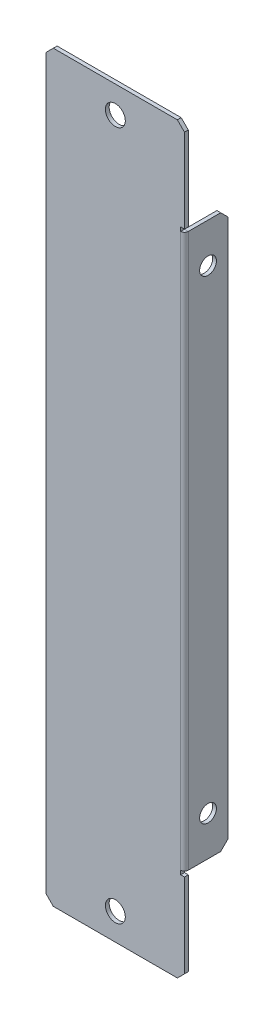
ISO-10303-21;
HEADER;
FILE_DESCRIPTION(('STEP AP214'),'2;1');
FILE_NAME('part.step','',(''),(''),'','','');
FILE_SCHEMA(('AUTOMOTIVE_DESIGN { 1 0 10303 214 1 1 1 1 }'));
ENDSEC;
DATA;
#1=APPLICATION_CONTEXT('core data for automotive mechanical design processes');
#2=APPLICATION_PROTOCOL_DEFINITION('international standard','automotive_design',2000,#1);
#3=PRODUCT_CONTEXT('',#1,'mechanical');
#4=PRODUCT('Part','Part','',(#3));
#5=PRODUCT_RELATED_PRODUCT_CATEGORY('part','',(#4));
#6=PRODUCT_DEFINITION_FORMATION('','',#4);
#7=PRODUCT_DEFINITION_CONTEXT('part definition',#1,'design');
#8=PRODUCT_DEFINITION('design','',#6,#7);
#9=PRODUCT_DEFINITION_SHAPE('','',#8);
#10=(LENGTH_UNIT() NAMED_UNIT(*) SI_UNIT(.MILLI.,.METRE.));
#11=(NAMED_UNIT(*) PLANE_ANGLE_UNIT() SI_UNIT($,.RADIAN.));
#12=(NAMED_UNIT(*) SI_UNIT($,.STERADIAN.) SOLID_ANGLE_UNIT());
#13=UNCERTAINTY_MEASURE_WITH_UNIT(LENGTH_MEASURE(1.E-05),#10,'distance_accuracy_value','');
#14=(GEOMETRIC_REPRESENTATION_CONTEXT(3) GLOBAL_UNCERTAINTY_ASSIGNED_CONTEXT((#13)) GLOBAL_UNIT_ASSIGNED_CONTEXT((#10,
#11,#12)) REPRESENTATION_CONTEXT('',''));
#15=CARTESIAN_POINT('',(0.,0.,0.));
#16=DIRECTION('',(0.,0.,1.));
#17=DIRECTION('',(1.,0.,0.));
#18=AXIS2_PLACEMENT_3D('',#15,#16,#17);
#19=CARTESIAN_POINT('',(22.225,119.4308,-1.2192));
#20=DIRECTION('',(1.,0.,0.));
#21=DIRECTION('',(0.,1.,0.));
#22=AXIS2_PLACEMENT_3D('',#19,#20,#21);
#23=PLANE('',#22);
#24=DIRECTION('',(0.,1.,0.));
#25=VECTOR('',#24,1.);
#26=CARTESIAN_POINT('',(22.225,119.4308,0.));
#27=LINE('',#26,#25);
#28=CARTESIAN_POINT('',(22.225,-117.1448,0.));
#29=VERTEX_POINT('',#28);
#30=CARTESIAN_POINT('',(22.225,-90.17,0.));
#31=VERTEX_POINT('',#30);
#32=EDGE_CURVE('E323',#29,#31,#27,.T.);
#33=ORIENTED_EDGE('',*,*,#32,.F.);
#34=DIRECTION('',(0.,0.,-1.));
#35=VECTOR('',#34,1.);
#36=CARTESIAN_POINT('',(22.225,-117.1448,-1.2192));
#37=LINE('',#36,#35);
#38=CARTESIAN_POINT('',(22.225,-117.1448,-1.2192));
#39=VERTEX_POINT('',#38);
#40=EDGE_CURVE('E386',#29,#39,#37,.T.);
#41=ORIENTED_EDGE('',*,*,#40,.T.);
#42=DIRECTION('',(0.,1.,0.));
#43=VECTOR('',#42,1.);
#44=CARTESIAN_POINT('',(22.225,119.4308,-1.2192));
#45=LINE('',#44,#43);
#46=CARTESIAN_POINT('',(22.225,-90.17,-1.21919999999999));
#47=VERTEX_POINT('',#46);
#48=EDGE_CURVE('E311',#39,#47,#45,.T.);
#49=ORIENTED_EDGE('',*,*,#48,.T.);
#50=DIRECTION('',(0.,0.,1.));
#51=VECTOR('',#50,1.);
#52=CARTESIAN_POINT('',(22.225,-90.17,-1.21919999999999));
#53=LINE('',#52,#51);
#54=EDGE_CURVE('E270',#47,#31,#53,.T.);
#55=ORIENTED_EDGE('',*,*,#54,.T.);
#56=EDGE_LOOP('',(#33,#41,#49,#55));
#57=FACE_BOUND('',#56,.T.);
#58=ADVANCED_FACE('F57',(#57),#23,.T.);
#59=CARTESIAN_POINT('',(22.225,90.17,-1.21919999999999));
#60=VERTEX_POINT('',#59);
#61=CARTESIAN_POINT('',(22.225,117.1448,-1.2192));
#62=VERTEX_POINT('',#61);
#63=EDGE_CURVE('E310',#60,#62,#45,.T.);
#64=ORIENTED_EDGE('',*,*,#63,.T.);
#65=DIRECTION('',(0.,0.,1.));
#66=VECTOR('',#65,1.);
#67=CARTESIAN_POINT('',(22.225,117.1448,-1.2192));
#68=LINE('',#67,#66);
#69=CARTESIAN_POINT('',(22.225,117.1448,0.));
#70=VERTEX_POINT('',#69);
#71=EDGE_CURVE('E343',#62,#70,#68,.T.);
#72=ORIENTED_EDGE('',*,*,#71,.T.);
#73=CARTESIAN_POINT('',(22.225,90.17,0.));
#74=VERTEX_POINT('',#73);
#75=EDGE_CURVE('E322',#74,#70,#27,.T.);
#76=ORIENTED_EDGE('',*,*,#75,.F.);
#77=DIRECTION('',(0.,0.,1.));
#78=VECTOR('',#77,1.);
#79=CARTESIAN_POINT('',(22.225,90.17,-1.21919999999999));
#80=LINE('',#79,#78);
#81=EDGE_CURVE('E280',#60,#74,#80,.T.);
#82=ORIENTED_EDGE('',*,*,#81,.F.);
#83=EDGE_LOOP('',(#64,#72,#76,#82));
#84=FACE_BOUND('',#83,.T.);
#85=ADVANCED_FACE('F425',(#84),#23,.T.);
#86=CARTESIAN_POINT('',(-22.225,-119.4308,-1.2192));
#87=DIRECTION('',(0.,0.,1.));
#88=DIRECTION('',(1.,0.,0.));
#89=AXIS2_PLACEMENT_3D('',#86,#87,#88);
#90=PLANE('',#89);
#91=CARTESIAN_POINT('',(0.,110.7948,-1.2192));
#92=DIRECTION('',(0.,0.,1.));
#93=DIRECTION('',(1.,0.,0.));
#94=AXIS2_PLACEMENT_3D('',#91,#92,#93);
#95=CIRCLE('',#94,3.2004);
#96=CARTESIAN_POINT('',(3.2004,110.7948,-1.2192));
#97=VERTEX_POINT('',#96);
#98=EDGE_CURVE('E297',#97,#97,#95,.T.);
#99=ORIENTED_EDGE('',*,*,#98,.T.);
#100=EDGE_LOOP('',(#99));
#101=FACE_BOUND('',#100,.T.);
#102=CARTESIAN_POINT('',(0.,-110.7948,-1.2192));
#103=DIRECTION('',(0.,0.,1.));
#104=DIRECTION('',(-1.,0.,0.));
#105=AXIS2_PLACEMENT_3D('',#102,#103,#104);
#106=CIRCLE('',#105,3.2004);
#107=CARTESIAN_POINT('',(-3.2004,-110.7948,-1.2192));
#108=VERTEX_POINT('',#107);
#109=EDGE_CURVE('E291',#108,#108,#106,.T.);
#110=ORIENTED_EDGE('',*,*,#109,.T.);
#111=EDGE_LOOP('',(#110));
#112=FACE_BOUND('',#111,.T.);
#113=ORIENTED_EDGE('',*,*,#48,.F.);
#114=DIRECTION('',(0.707106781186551,0.707106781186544,0.));
#115=VECTOR('',#114,1.);
#116=CARTESIAN_POINT('',(19.939,-119.4308,-1.2192));
#117=LINE('',#116,#115);
#118=CARTESIAN_POINT('',(19.939,-119.4308,-1.2192));
#119=VERTEX_POINT('',#118);
#120=EDGE_CURVE('E388',#39,#119,#117,.F.);
#121=ORIENTED_EDGE('',*,*,#120,.T.);
#122=DIRECTION('',(1.,0.,0.));
#123=VECTOR('',#122,1.);
#124=CARTESIAN_POINT('',(-22.225,-119.4308,-1.2192));
#125=LINE('',#124,#123);
#126=CARTESIAN_POINT('',(-19.939,-119.4308,-1.2192));
#127=VERTEX_POINT('',#126);
#128=EDGE_CURVE('E306',#127,#119,#125,.T.);
#129=ORIENTED_EDGE('',*,*,#128,.F.);
#130=DIRECTION('',(0.70710678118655,-0.707106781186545,0.));
#131=VECTOR('',#130,1.);
#132=CARTESIAN_POINT('',(-22.225,-117.1448,-1.2192));
#133=LINE('',#132,#131);
#134=CARTESIAN_POINT('',(-22.225,-117.1448,-1.2192));
#135=VERTEX_POINT('',#134);
#136=EDGE_CURVE('E379',#127,#135,#133,.F.);
#137=ORIENTED_EDGE('',*,*,#136,.T.);
#138=DIRECTION('',(0.,-1.,0.));
#139=VECTOR('',#138,1.);
#140=CARTESIAN_POINT('',(-22.225,119.4308,-1.2192));
#141=LINE('',#140,#139);
#142=CARTESIAN_POINT('',(-22.225,117.1448,-1.2192));
#143=VERTEX_POINT('',#142);
#144=EDGE_CURVE('E303',#143,#135,#141,.T.);
#145=ORIENTED_EDGE('',*,*,#144,.F.);
#146=DIRECTION('',(-0.707106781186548,-0.707106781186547,0.));
#147=VECTOR('',#146,1.);
#148=CARTESIAN_POINT('',(-19.939,119.4308,-1.2192));
#149=LINE('',#148,#147);
#150=CARTESIAN_POINT('',(-19.939,119.4308,-1.2192));
#151=VERTEX_POINT('',#150);
#152=EDGE_CURVE('E370',#143,#151,#149,.F.);
#153=ORIENTED_EDGE('',*,*,#152,.T.);
#154=DIRECTION('',(-1.,0.,0.));
#155=VECTOR('',#154,1.);
#156=CARTESIAN_POINT('',(-22.225,119.4308,-1.2192));
#157=LINE('',#156,#155);
#158=CARTESIAN_POINT('',(19.939,119.4308,-1.2192));
#159=VERTEX_POINT('',#158);
#160=EDGE_CURVE('E313',#159,#151,#157,.T.);
#161=ORIENTED_EDGE('',*,*,#160,.F.);
#162=DIRECTION('',(-0.707106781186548,0.707106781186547,0.));
#163=VECTOR('',#162,1.);
#164=CARTESIAN_POINT('',(22.225,117.1448,-1.2192));
#165=LINE('',#164,#163);
#166=EDGE_CURVE('E350',#159,#62,#165,.F.);
#167=ORIENTED_EDGE('',*,*,#166,.T.);
#168=ORIENTED_EDGE('',*,*,#63,.F.);
#169=DIRECTION('',(1.,0.,0.));
#170=VECTOR('',#169,1.);
#171=CARTESIAN_POINT('',(21.00326,90.17,-1.21919999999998));
#172=LINE('',#171,#170);
#173=CARTESIAN_POINT('',(21.00326,90.17,-1.21919999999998));
#174=VERTEX_POINT('',#173);
#175=EDGE_CURVE('E278',#174,#60,#172,.T.);
#176=ORIENTED_EDGE('',*,*,#175,.F.);
#177=DIRECTION('',(0.,1.,0.));
#178=VECTOR('',#177,1.);
#179=CARTESIAN_POINT('',(21.00326,88.9,-1.21919999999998));
#180=LINE('',#179,#178);
#181=CARTESIAN_POINT('',(21.00326,88.9,-1.21919999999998));
#182=VERTEX_POINT('',#181);
#183=EDGE_CURVE('E274',#182,#174,#180,.T.);
#184=ORIENTED_EDGE('',*,*,#183,.F.);
#185=DIRECTION('',(-1.,0.,0.));
#186=VECTOR('',#185,1.);
#187=CARTESIAN_POINT('',(21.0058,88.9,-1.21919999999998));
#188=LINE('',#187,#186);
#189=CARTESIAN_POINT('',(21.0058,88.9,-1.21919999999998));
#190=VERTEX_POINT('',#189);
#191=EDGE_CURVE('E223',#190,#182,#188,.T.);
#192=ORIENTED_EDGE('',*,*,#191,.F.);
#193=DIRECTION('',(0.,-1.,0.));
#194=VECTOR('',#193,1.);
#195=CARTESIAN_POINT('',(21.0058,-88.9,-1.21919999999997));
#196=LINE('',#195,#194);
#197=CARTESIAN_POINT('',(21.0058,-88.9,-1.21919999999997));
#198=VERTEX_POINT('',#197);
#199=EDGE_CURVE('E216',#190,#198,#196,.T.);
#200=ORIENTED_EDGE('',*,*,#199,.T.);
#201=DIRECTION('',(1.,0.,0.));
#202=VECTOR('',#201,1.);
#203=CARTESIAN_POINT('',(21.00326,-88.9,-1.21919999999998));
#204=LINE('',#203,#202);
#205=CARTESIAN_POINT('',(21.00326,-88.9,-1.21919999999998));
#206=VERTEX_POINT('',#205);
#207=EDGE_CURVE('E220',#206,#198,#204,.T.);
#208=ORIENTED_EDGE('',*,*,#207,.F.);
#209=DIRECTION('',(0.,1.,0.));
#210=VECTOR('',#209,1.);
#211=CARTESIAN_POINT('',(21.00326,-90.17,-1.21919999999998));
#212=LINE('',#211,#210);
#213=CARTESIAN_POINT('',(21.00326,-90.17,-1.21919999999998));
#214=VERTEX_POINT('',#213);
#215=EDGE_CURVE('E271',#214,#206,#212,.T.);
#216=ORIENTED_EDGE('',*,*,#215,.F.);
#217=DIRECTION('',(-1.,0.,0.));
#218=VECTOR('',#217,1.);
#219=CARTESIAN_POINT('',(22.225,-90.17,-1.21919999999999));
#220=LINE('',#219,#218);
#221=EDGE_CURVE('E266',#47,#214,#220,.T.);
#222=ORIENTED_EDGE('',*,*,#221,.F.);
#223=EDGE_LOOP('',(#113,#121,#129,#137,#145,#153,#161,#167,#168,#176,#184,#192,#200,#208,#216,#222));
#224=FACE_BOUND('',#223,.T.);
#225=ADVANCED_FACE('F218',(#101,#112,#224),#90,.F.);
#226=CARTESIAN_POINT('',(-22.225,-119.4308,0.));
#227=DIRECTION('',(0.,0.,1.));
#228=DIRECTION('',(1.,0.,0.));
#229=AXIS2_PLACEMENT_3D('',#226,#227,#228);
#230=PLANE('',#229);
#231=CARTESIAN_POINT('',(0.,110.7948,0.));
#232=DIRECTION('',(0.,0.,1.));
#233=DIRECTION('',(1.,0.,0.));
#234=AXIS2_PLACEMENT_3D('',#231,#232,#233);
#235=CIRCLE('',#234,3.2004);
#236=CARTESIAN_POINT('',(3.2004,110.7948,0.));
#237=VERTEX_POINT('',#236);
#238=EDGE_CURVE('E294',#237,#237,#235,.T.);
#239=ORIENTED_EDGE('',*,*,#238,.F.);
#240=EDGE_LOOP('',(#239));
#241=FACE_BOUND('',#240,.T.);
#242=CARTESIAN_POINT('',(0.,-110.7948,0.));
#243=DIRECTION('',(0.,0.,1.));
#244=DIRECTION('',(-1.,0.,0.));
#245=AXIS2_PLACEMENT_3D('',#242,#243,#244);
#246=CIRCLE('',#245,3.2004);
#247=CARTESIAN_POINT('',(-3.2004,-110.7948,0.));
#248=VERTEX_POINT('',#247);
#249=EDGE_CURVE('E269',#248,#248,#246,.T.);
#250=ORIENTED_EDGE('',*,*,#249,.F.);
#251=EDGE_LOOP('',(#250));
#252=FACE_BOUND('',#251,.T.);
#253=DIRECTION('',(1.,0.,0.));
#254=VECTOR('',#253,1.);
#255=CARTESIAN_POINT('',(-22.225,-119.4308,0.));
#256=LINE('',#255,#254);
#257=CARTESIAN_POINT('',(-19.939,-119.4308,0.));
#258=VERTEX_POINT('',#257);
#259=CARTESIAN_POINT('',(19.939,-119.4308,0.));
#260=VERTEX_POINT('',#259);
#261=EDGE_CURVE('E319',#258,#260,#256,.T.);
#262=ORIENTED_EDGE('',*,*,#261,.T.);
#263=DIRECTION('',(-0.707106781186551,-0.707106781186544,0.));
#264=VECTOR('',#263,1.);
#265=CARTESIAN_POINT('',(-1.14300000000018,-140.5128,0.));
#266=LINE('',#265,#264);
#267=EDGE_CURVE('E384',#260,#29,#266,.F.);
#268=ORIENTED_EDGE('',*,*,#267,.T.);
#269=ORIENTED_EDGE('',*,*,#32,.T.);
#270=DIRECTION('',(-1.,0.,0.));
#271=VECTOR('',#270,1.);
#272=CARTESIAN_POINT('',(-22.225,-90.17,0.));
#273=LINE('',#272,#271);
#274=CARTESIAN_POINT('',(21.00326,-90.17,0.));
#275=VERTEX_POINT('',#274);
#276=EDGE_CURVE('E340',#31,#275,#273,.T.);
#277=ORIENTED_EDGE('',*,*,#276,.T.);
#278=DIRECTION('',(0.,1.,0.));
#279=VECTOR('',#278,1.);
#280=CARTESIAN_POINT('',(21.00326,-119.4308,0.));
#281=LINE('',#280,#279);
#282=CARTESIAN_POINT('',(21.00326,-88.9,0.));
#283=VERTEX_POINT('',#282);
#284=EDGE_CURVE('E337',#275,#283,#281,.T.);
#285=ORIENTED_EDGE('',*,*,#284,.T.);
#286=DIRECTION('',(1.,0.,0.));
#287=VECTOR('',#286,1.);
#288=CARTESIAN_POINT('',(-22.225,-88.9,0.));
#289=LINE('',#288,#287);
#290=CARTESIAN_POINT('',(21.0058,-88.9,0.));
#291=VERTEX_POINT('',#290);
#292=EDGE_CURVE('E335',#283,#291,#289,.T.);
#293=ORIENTED_EDGE('',*,*,#292,.T.);
#294=DIRECTION('',(0.,1.,0.));
#295=VECTOR('',#294,1.);
#296=CARTESIAN_POINT('',(21.0058,-88.9,0.));
#297=LINE('',#296,#295);
#298=CARTESIAN_POINT('',(21.0058,88.9,0.));
#299=VERTEX_POINT('',#298);
#300=EDGE_CURVE('E210',#299,#291,#297,.F.);
#301=ORIENTED_EDGE('',*,*,#300,.F.);
#302=DIRECTION('',(-1.,0.,0.));
#303=VECTOR('',#302,1.);
#304=CARTESIAN_POINT('',(-22.225,88.9,0.));
#305=LINE('',#304,#303);
#306=CARTESIAN_POINT('',(21.00326,88.9,0.));
#307=VERTEX_POINT('',#306);
#308=EDGE_CURVE('E332',#299,#307,#305,.T.);
#309=ORIENTED_EDGE('',*,*,#308,.T.);
#310=DIRECTION('',(0.,1.,0.));
#311=VECTOR('',#310,1.);
#312=CARTESIAN_POINT('',(21.00326,-119.4308,0.));
#313=LINE('',#312,#311);
#314=CARTESIAN_POINT('',(21.00326,90.17,0.));
#315=VERTEX_POINT('',#314);
#316=EDGE_CURVE('E329',#307,#315,#313,.T.);
#317=ORIENTED_EDGE('',*,*,#316,.T.);
#318=DIRECTION('',(1.,0.,0.));
#319=VECTOR('',#318,1.);
#320=CARTESIAN_POINT('',(-22.225,90.17,0.));
#321=LINE('',#320,#319);
#322=EDGE_CURVE('E316',#315,#74,#321,.T.);
#323=ORIENTED_EDGE('',*,*,#322,.T.);
#324=ORIENTED_EDGE('',*,*,#75,.T.);
#325=DIRECTION('',(0.707106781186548,-0.707106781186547,0.));
#326=VECTOR('',#325,1.);
#327=CARTESIAN_POINT('',(118.2878,21.0820000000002,0.));
#328=LINE('',#327,#326);
#329=CARTESIAN_POINT('',(19.939,119.4308,0.));
#330=VERTEX_POINT('',#329);
#331=EDGE_CURVE('E346',#70,#330,#328,.F.);
#332=ORIENTED_EDGE('',*,*,#331,.T.);
#333=DIRECTION('',(-1.,0.,0.));
#334=VECTOR('',#333,1.);
#335=CARTESIAN_POINT('',(-22.225,119.4308,0.));
#336=LINE('',#335,#334);
#337=CARTESIAN_POINT('',(-19.939,119.4308,0.));
#338=VERTEX_POINT('',#337);
#339=EDGE_CURVE('E307',#330,#338,#336,.T.);
#340=ORIENTED_EDGE('',*,*,#339,.T.);
#341=DIRECTION('',(0.707106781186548,0.707106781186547,0.));
#342=VECTOR('',#341,1.);
#343=CARTESIAN_POINT('',(-140.5128,-1.1429999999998,0.));
#344=LINE('',#343,#342);
#345=CARTESIAN_POINT('',(-22.225,117.1448,0.));
#346=VERTEX_POINT('',#345);
#347=EDGE_CURVE('E366',#338,#346,#344,.F.);
#348=ORIENTED_EDGE('',*,*,#347,.T.);
#349=DIRECTION('',(0.,-1.,0.));
#350=VECTOR('',#349,1.);
#351=CARTESIAN_POINT('',(-22.225,119.4308,0.));
#352=LINE('',#351,#350);
#353=CARTESIAN_POINT('',(-22.225,-117.1448,0.));
#354=VERTEX_POINT('',#353);
#355=EDGE_CURVE('E300',#346,#354,#352,.T.);
#356=ORIENTED_EDGE('',*,*,#355,.T.);
#357=DIRECTION('',(-0.70710678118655,0.707106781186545,0.));
#358=VECTOR('',#357,1.);
#359=CARTESIAN_POINT('',(-21.082,-118.2878,0.));
#360=LINE('',#359,#358);
#361=EDGE_CURVE('E375',#354,#258,#360,.F.);
#362=ORIENTED_EDGE('',*,*,#361,.T.);
#363=EDGE_LOOP('',(#262,#268,#269,#277,#285,#293,#301,#309,#317,#323,#324,#332,#340,#348,#356,#362));
#364=FACE_BOUND('',#363,.T.);
#365=ADVANCED_FACE('F445',(#241,#252,#364),#230,.T.);
#366=CARTESIAN_POINT('',(-22.225,119.4308,-1.2192));
#367=DIRECTION('',(-1.,0.,0.));
#368=DIRECTION('',(0.,-1.,0.));
#369=AXIS2_PLACEMENT_3D('',#366,#367,#368);
#370=PLANE('',#369);
#371=ORIENTED_EDGE('',*,*,#144,.T.);
#372=DIRECTION('',(0.,0.,1.));
#373=VECTOR('',#372,1.);
#374=CARTESIAN_POINT('',(-22.225,-117.1448,-1.2192));
#375=LINE('',#374,#373);
#376=EDGE_CURVE('E372',#135,#354,#375,.T.);
#377=ORIENTED_EDGE('',*,*,#376,.T.);
#378=ORIENTED_EDGE('',*,*,#355,.F.);
#379=DIRECTION('',(0.,0.,-1.));
#380=VECTOR('',#379,1.);
#381=CARTESIAN_POINT('',(-22.225,117.1448,-1.2192));
#382=LINE('',#381,#380);
#383=EDGE_CURVE('E368',#346,#143,#382,.T.);
#384=ORIENTED_EDGE('',*,*,#383,.T.);
#385=EDGE_LOOP('',(#371,#377,#378,#384));
#386=FACE_BOUND('',#385,.T.);
#387=ADVANCED_FACE('F442',(#386),#370,.T.);
#388=CARTESIAN_POINT('',(-22.225,119.4308,-1.2192));
#389=DIRECTION('',(0.,1.,0.));
#390=DIRECTION('',(0.,0.,1.));
#391=AXIS2_PLACEMENT_3D('',#388,#389,#390);
#392=PLANE('',#391);
#393=ORIENTED_EDGE('',*,*,#160,.T.);
#394=DIRECTION('',(0.,0.,1.));
#395=VECTOR('',#394,1.);
#396=CARTESIAN_POINT('',(-19.939,119.4308,-1.2192));
#397=LINE('',#396,#395);
#398=EDGE_CURVE('E363',#151,#338,#397,.T.);
#399=ORIENTED_EDGE('',*,*,#398,.T.);
#400=ORIENTED_EDGE('',*,*,#339,.F.);
#401=DIRECTION('',(0.,0.,-1.));
#402=VECTOR('',#401,1.);
#403=CARTESIAN_POINT('',(19.939,119.4308,-1.2192));
#404=LINE('',#403,#402);
#405=EDGE_CURVE('E348',#330,#159,#404,.T.);
#406=ORIENTED_EDGE('',*,*,#405,.T.);
#407=EDGE_LOOP('',(#393,#399,#400,#406));
#408=FACE_BOUND('',#407,.T.);
#409=ADVANCED_FACE('F435',(#408),#392,.T.);
#410=CARTESIAN_POINT('',(-22.225,-119.4308,-1.2192));
#411=DIRECTION('',(0.,-1.,0.));
#412=DIRECTION('',(0.,0.,-1.));
#413=AXIS2_PLACEMENT_3D('',#410,#411,#412);
#414=PLANE('',#413);
#415=ORIENTED_EDGE('',*,*,#128,.T.);
#416=DIRECTION('',(0.,0.,1.));
#417=VECTOR('',#416,1.);
#418=CARTESIAN_POINT('',(19.939,-119.4308,-1.2192));
#419=LINE('',#418,#417);
#420=EDGE_CURVE('E381',#119,#260,#419,.T.);
#421=ORIENTED_EDGE('',*,*,#420,.T.);
#422=ORIENTED_EDGE('',*,*,#261,.F.);
#423=DIRECTION('',(0.,0.,-1.));
#424=VECTOR('',#423,1.);
#425=CARTESIAN_POINT('',(-19.939,-119.4308,-1.2192));
#426=LINE('',#425,#424);
#427=EDGE_CURVE('E377',#258,#127,#426,.T.);
#428=ORIENTED_EDGE('',*,*,#427,.T.);
#429=EDGE_LOOP('',(#415,#421,#422,#428));
#430=FACE_BOUND('',#429,.T.);
#431=ADVANCED_FACE('F437',(#430),#414,.T.);
#432=CARTESIAN_POINT('',(0.,110.7948,-1.2192));
#433=DIRECTION('',(0.,0.,1.));
#434=DIRECTION('',(1.,0.,0.));
#435=AXIS2_PLACEMENT_3D('',#432,#433,#434);
#436=CYLINDRICAL_SURFACE('',#435,3.2004);
#437=ORIENTED_EDGE('',*,*,#98,.F.);
#438=EDGE_LOOP('',(#437));
#439=FACE_BOUND('',#438,.T.);
#440=ORIENTED_EDGE('',*,*,#238,.T.);
#441=EDGE_LOOP('',(#440));
#442=FACE_BOUND('',#441,.T.);
#443=ADVANCED_FACE('F440',(#439,#442),#436,.F.);
#444=CARTESIAN_POINT('',(0.,-110.7948,-1.2192));
#445=DIRECTION('',(0.,0.,1.));
#446=DIRECTION('',(1.,0.,0.));
#447=AXIS2_PLACEMENT_3D('',#444,#445,#446);
#448=CYLINDRICAL_SURFACE('',#447,3.2004);
#449=ORIENTED_EDGE('',*,*,#109,.F.);
#450=EDGE_LOOP('',(#449));
#451=FACE_BOUND('',#450,.T.);
#452=ORIENTED_EDGE('',*,*,#249,.T.);
#453=EDGE_LOOP('',(#452));
#454=FACE_BOUND('',#453,.T.);
#455=ADVANCED_FACE('F508',(#451,#454),#448,.F.);
#456=CARTESIAN_POINT('',(22.225,-90.17,-1.21919999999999));
#457=DIRECTION('',(0.,1.,0.));
#458=DIRECTION('',(0.,0.,1.));
#459=AXIS2_PLACEMENT_3D('',#456,#457,#458);
#460=PLANE('',#459);
#461=ORIENTED_EDGE('',*,*,#276,.F.);
#462=ORIENTED_EDGE('',*,*,#54,.F.);
#463=ORIENTED_EDGE('',*,*,#221,.T.);
#464=DIRECTION('',(0.,0.,1.));
#465=VECTOR('',#464,1.);
#466=CARTESIAN_POINT('',(21.00326,-90.17,-1.21919999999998));
#467=LINE('',#466,#465);
#468=EDGE_CURVE('E233',#214,#275,#467,.T.);
#469=ORIENTED_EDGE('',*,*,#468,.T.);
#470=EDGE_LOOP('',(#461,#462,#463,#469));
#471=FACE_BOUND('',#470,.T.);
#472=ADVANCED_FACE('F504',(#471),#460,.T.);
#473=CARTESIAN_POINT('',(21.00326,-90.17,-1.21919999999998));
#474=DIRECTION('',(1.,0.,0.));
#475=DIRECTION('',(0.,0.,-1.));
#476=AXIS2_PLACEMENT_3D('',#473,#474,#475);
#477=PLANE('',#476);
#478=ORIENTED_EDGE('',*,*,#284,.F.);
#479=ORIENTED_EDGE('',*,*,#468,.F.);
#480=ORIENTED_EDGE('',*,*,#215,.T.);
#481=DIRECTION('',(0.,0.,1.));
#482=VECTOR('',#481,1.);
#483=CARTESIAN_POINT('',(21.00326,-88.9,-1.21919999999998));
#484=LINE('',#483,#482);
#485=EDGE_CURVE('E231',#206,#283,#484,.T.);
#486=ORIENTED_EDGE('',*,*,#485,.T.);
#487=EDGE_LOOP('',(#478,#479,#480,#486));
#488=FACE_BOUND('',#487,.T.);
#489=ADVANCED_FACE('F498',(#488),#477,.T.);
#490=CARTESIAN_POINT('',(21.00326,-88.9,-1.21919999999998));
#491=DIRECTION('',(0.,-1.,0.));
#492=DIRECTION('',(0.,0.,-1.));
#493=AXIS2_PLACEMENT_3D('',#490,#491,#492);
#494=PLANE('',#493);
#495=ORIENTED_EDGE('',*,*,#292,.F.);
#496=ORIENTED_EDGE('',*,*,#485,.F.);
#497=ORIENTED_EDGE('',*,*,#207,.T.);
#498=DIRECTION('',(0.,0.,-1.));
#499=VECTOR('',#498,1.);
#500=CARTESIAN_POINT('',(21.0058,-88.9,0.));
#501=LINE('',#500,#499);
#502=EDGE_CURVE('E200',#291,#198,#501,.T.);
#503=ORIENTED_EDGE('',*,*,#502,.F.);
#504=EDGE_LOOP('',(#495,#496,#497,#503));
#505=FACE_BOUND('',#504,.T.);
#506=ADVANCED_FACE('F229',(#505),#494,.T.);
#507=CARTESIAN_POINT('',(21.0058,88.9,-1.21919999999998));
#508=DIRECTION('',(0.,1.,0.));
#509=DIRECTION('',(0.,0.,1.));
#510=AXIS2_PLACEMENT_3D('',#507,#508,#509);
#511=PLANE('',#510);
#512=ORIENTED_EDGE('',*,*,#308,.F.);
#513=DIRECTION('',(0.,0.,-1.));
#514=VECTOR('',#513,1.);
#515=CARTESIAN_POINT('',(21.0058,88.9,0.));
#516=LINE('',#515,#514);
#517=EDGE_CURVE('E258',#299,#190,#516,.T.);
#518=ORIENTED_EDGE('',*,*,#517,.T.);
#519=ORIENTED_EDGE('',*,*,#191,.T.);
#520=DIRECTION('',(0.,0.,1.));
#521=VECTOR('',#520,1.);
#522=CARTESIAN_POINT('',(21.00326,88.9,-1.21919999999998));
#523=LINE('',#522,#521);
#524=EDGE_CURVE('E277',#182,#307,#523,.T.);
#525=ORIENTED_EDGE('',*,*,#524,.T.);
#526=EDGE_LOOP('',(#512,#518,#519,#525));
#527=FACE_BOUND('',#526,.T.);
#528=ADVANCED_FACE('F490',(#527),#511,.T.);
#529=CARTESIAN_POINT('',(21.00326,88.9,-1.21919999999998));
#530=DIRECTION('',(1.,0.,0.));
#531=DIRECTION('',(0.,0.,-1.));
#532=AXIS2_PLACEMENT_3D('',#529,#530,#531);
#533=PLANE('',#532);
#534=ORIENTED_EDGE('',*,*,#316,.F.);
#535=ORIENTED_EDGE('',*,*,#524,.F.);
#536=ORIENTED_EDGE('',*,*,#183,.T.);
#537=DIRECTION('',(0.,0.,1.));
#538=VECTOR('',#537,1.);
#539=CARTESIAN_POINT('',(21.00326,90.17,-1.21919999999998));
#540=LINE('',#539,#538);
#541=EDGE_CURVE('E265',#174,#315,#540,.T.);
#542=ORIENTED_EDGE('',*,*,#541,.T.);
#543=EDGE_LOOP('',(#534,#535,#536,#542));
#544=FACE_BOUND('',#543,.T.);
#545=ADVANCED_FACE('F488',(#544),#533,.T.);
#546=CARTESIAN_POINT('',(21.00326,90.17,-1.21919999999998));
#547=DIRECTION('',(0.,-1.,0.));
#548=DIRECTION('',(0.,0.,-1.));
#549=AXIS2_PLACEMENT_3D('',#546,#547,#548);
#550=PLANE('',#549);
#551=ORIENTED_EDGE('',*,*,#322,.F.);
#552=ORIENTED_EDGE('',*,*,#541,.F.);
#553=ORIENTED_EDGE('',*,*,#175,.T.);
#554=ORIENTED_EDGE('',*,*,#81,.T.);
#555=EDGE_LOOP('',(#551,#552,#553,#554));
#556=FACE_BOUND('',#555,.T.);
#557=ADVANCED_FACE('F484',(#556),#550,.T.);
#558=CARTESIAN_POINT('',(21.0058,-88.9,0.));
#559=DIRECTION('',(0.,-1.,0.));
#560=DIRECTION('',(1.,0.,0.));
#561=AXIS2_PLACEMENT_3D('',#558,#559,#560);
#562=PLANE('',#561);
#563=CARTESIAN_POINT('',(21.0058,-88.9,-1.21919999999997));
#564=DIRECTION('',(0.,1.,0.));
#565=DIRECTION('',(-1.,0.,0.));
#566=AXIS2_PLACEMENT_3D('',#563,#564,#565);
#567=CIRCLE('',#566,1.2192);
#568=CARTESIAN_POINT('',(22.225,-88.9,-1.21919999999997));
#569=VERTEX_POINT('',#568);
#570=EDGE_CURVE('E205',#291,#569,#567,.T.);
#571=ORIENTED_EDGE('',*,*,#570,.F.);
#572=ORIENTED_EDGE('',*,*,#502,.T.);
#573=DIRECTION('',(-1.,0.,0.));
#574=VECTOR('',#573,1.);
#575=CARTESIAN_POINT('',(22.225,-88.9,-1.21919999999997));
#576=LINE('',#575,#574);
#577=EDGE_CURVE('E204',#569,#198,#576,.T.);
#578=ORIENTED_EDGE('',*,*,#577,.F.);
#579=EDGE_LOOP('',(#571,#572,#578));
#580=FACE_BOUND('',#579,.T.);
#581=ADVANCED_FACE('F202',(#580),#562,.T.);
#582=CARTESIAN_POINT('',(21.0058,88.9,-1.21919999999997));
#583=DIRECTION('',(0.,1.,0.));
#584=DIRECTION('',(-1.,0.,0.));
#585=AXIS2_PLACEMENT_3D('',#582,#583,#584);
#586=CYLINDRICAL_SURFACE('',#585,1.2192);
#587=CARTESIAN_POINT('',(21.0058,88.9,-1.21919999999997));
#588=DIRECTION('',(0.,1.,0.));
#589=DIRECTION('',(-1.,0.,0.));
#590=AXIS2_PLACEMENT_3D('',#587,#588,#589);
#591=CIRCLE('',#590,1.2192);
#592=CARTESIAN_POINT('',(22.225,88.9,-1.21919999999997));
#593=VERTEX_POINT('',#592);
#594=EDGE_CURVE('E261',#299,#593,#591,.T.);
#595=ORIENTED_EDGE('',*,*,#594,.F.);
#596=ORIENTED_EDGE('',*,*,#300,.T.);
#597=ORIENTED_EDGE('',*,*,#570,.T.);
#598=DIRECTION('',(0.,1.,0.));
#599=VECTOR('',#598,1.);
#600=CARTESIAN_POINT('',(22.225,-88.9,-1.21919999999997));
#601=LINE('',#600,#599);
#602=EDGE_CURVE('E252',#593,#569,#601,.F.);
#603=ORIENTED_EDGE('',*,*,#602,.F.);
#604=EDGE_LOOP('',(#595,#596,#597,#603));
#605=FACE_BOUND('',#604,.T.);
#606=ADVANCED_FACE('F416',(#605),#586,.T.);
#607=CARTESIAN_POINT('',(21.0058,88.9,0.));
#608=DIRECTION('',(0.,-1.,0.));
#609=DIRECTION('',(1.,0.,0.));
#610=AXIS2_PLACEMENT_3D('',#607,#608,#609);
#611=PLANE('',#610);
#612=ORIENTED_EDGE('',*,*,#517,.F.);
#613=ORIENTED_EDGE('',*,*,#594,.T.);
#614=DIRECTION('',(-1.,0.,0.));
#615=VECTOR('',#614,1.);
#616=CARTESIAN_POINT('',(22.225,88.9,-1.21919999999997));
#617=LINE('',#616,#615);
#618=EDGE_CURVE('E241',#593,#190,#617,.T.);
#619=ORIENTED_EDGE('',*,*,#618,.T.);
#620=EDGE_LOOP('',(#612,#613,#619));
#621=FACE_BOUND('',#620,.T.);
#622=ADVANCED_FACE('F412',(#621),#611,.F.);
#623=CARTESIAN_POINT('',(22.2250000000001,-88.9,-13.9192));
#624=DIRECTION('',(0.,1.,0.));
#625=DIRECTION('',(0.,0.,1.));
#626=AXIS2_PLACEMENT_3D('',#623,#624,#625);
#627=PLANE('',#626);
#628=DIRECTION('',(0.,0.,-1.));
#629=VECTOR('',#628,1.);
#630=CARTESIAN_POINT('',(21.0058000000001,-88.9,-13.9192));
#631=LINE('',#630,#629);
#632=CARTESIAN_POINT('',(21.0058000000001,-88.9,-11.6332));
#633=VERTEX_POINT('',#632);
#634=EDGE_CURVE('E226',#198,#633,#631,.T.);
#635=ORIENTED_EDGE('',*,*,#634,.T.);
#636=DIRECTION('',(1.,0.,0.));
#637=VECTOR('',#636,1.);
#638=CARTESIAN_POINT('',(22.2250000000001,-88.9,-11.6332));
#639=LINE('',#638,#637);
#640=CARTESIAN_POINT('',(22.2250000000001,-88.9,-11.6332));
#641=VERTEX_POINT('',#640);
#642=EDGE_CURVE('E65',#633,#641,#639,.T.);
#643=ORIENTED_EDGE('',*,*,#642,.T.);
#644=DIRECTION('',(0.,0.,1.));
#645=VECTOR('',#644,1.);
#646=CARTESIAN_POINT('',(22.225,-88.9,-1.21919999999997));
#647=LINE('',#646,#645);
#648=EDGE_CURVE('E239',#569,#641,#647,.F.);
#649=ORIENTED_EDGE('',*,*,#648,.F.);
#650=ORIENTED_EDGE('',*,*,#577,.T.);
#651=EDGE_LOOP('',(#635,#643,#649,#650));
#652=FACE_BOUND('',#651,.T.);
#653=ADVANCED_FACE('F238',(#652),#627,.F.);
#654=CARTESIAN_POINT('',(22.225,88.9,-13.9192));
#655=DIRECTION('',(0.,0.,1.));
#656=DIRECTION('',(1.,0.,0.));
#657=AXIS2_PLACEMENT_3D('',#654,#655,#656);
#658=PLANE('',#657);
#659=DIRECTION('',(0.,-1.,0.));
#660=VECTOR('',#659,1.);
#661=CARTESIAN_POINT('',(22.2250000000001,-88.9,-13.9192));
#662=LINE('',#661,#660);
#663=CARTESIAN_POINT('',(22.2250000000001,-86.614,-13.9192));
#664=VERTEX_POINT('',#663);
#665=CARTESIAN_POINT('',(22.2250000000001,86.614,-13.9192));
#666=VERTEX_POINT('',#665);
#667=EDGE_CURVE('E249',#664,#666,#662,.F.);
#668=ORIENTED_EDGE('',*,*,#667,.F.);
#669=DIRECTION('',(-1.,0.,0.));
#670=VECTOR('',#669,1.);
#671=CARTESIAN_POINT('',(22.2250000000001,-86.614,-13.9192));
#672=LINE('',#671,#670);
#673=CARTESIAN_POINT('',(21.0058000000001,-86.614,-13.9192));
#674=VERTEX_POINT('',#673);
#675=EDGE_CURVE('E390',#664,#674,#672,.T.);
#676=ORIENTED_EDGE('',*,*,#675,.T.);
#677=DIRECTION('',(0.,1.,0.));
#678=VECTOR('',#677,1.);
#679=CARTESIAN_POINT('',(21.0058000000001,88.9,-13.9192));
#680=LINE('',#679,#678);
#681=CARTESIAN_POINT('',(21.0058000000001,86.614,-13.9192));
#682=VERTEX_POINT('',#681);
#683=EDGE_CURVE('E236',#674,#682,#680,.T.);
#684=ORIENTED_EDGE('',*,*,#683,.T.);
#685=DIRECTION('',(1.,0.,0.));
#686=VECTOR('',#685,1.);
#687=CARTESIAN_POINT('',(22.225,86.614,-13.9192));
#688=LINE('',#687,#686);
#689=EDGE_CURVE('E358',#682,#666,#688,.T.);
#690=ORIENTED_EDGE('',*,*,#689,.T.);
#691=EDGE_LOOP('',(#668,#676,#684,#690));
#692=FACE_BOUND('',#691,.T.);
#693=ADVANCED_FACE('F396',(#692),#658,.F.);
#694=CARTESIAN_POINT('',(22.225,88.9,-1.21919999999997));
#695=DIRECTION('',(0.,-1.,0.));
#696=DIRECTION('',(0.,0.,-1.));
#697=AXIS2_PLACEMENT_3D('',#694,#695,#696);
#698=PLANE('',#697);
#699=DIRECTION('',(0.,0.,-1.));
#700=VECTOR('',#699,1.);
#701=CARTESIAN_POINT('',(22.225,88.9,-1.21920000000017));
#702=LINE('',#701,#700);
#703=CARTESIAN_POINT('',(22.225,88.9,-11.6332));
#704=VERTEX_POINT('',#703);
#705=EDGE_CURVE('E243',#704,#593,#702,.F.);
#706=ORIENTED_EDGE('',*,*,#705,.F.);
#707=DIRECTION('',(-1.,0.,0.));
#708=VECTOR('',#707,1.);
#709=CARTESIAN_POINT('',(22.225,88.9,-11.6332));
#710=LINE('',#709,#708);
#711=CARTESIAN_POINT('',(21.0058,88.9,-11.6332));
#712=VERTEX_POINT('',#711);
#713=EDGE_CURVE('E352',#704,#712,#710,.T.);
#714=ORIENTED_EDGE('',*,*,#713,.T.);
#715=DIRECTION('',(0.,0.,1.));
#716=VECTOR('',#715,1.);
#717=CARTESIAN_POINT('',(21.0058,88.9,-1.21919999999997));
#718=LINE('',#717,#716);
#719=EDGE_CURVE('E254',#712,#190,#718,.T.);
#720=ORIENTED_EDGE('',*,*,#719,.T.);
#721=ORIENTED_EDGE('',*,*,#618,.F.);
#722=EDGE_LOOP('',(#706,#714,#720,#721));
#723=FACE_BOUND('',#722,.T.);
#724=ADVANCED_FACE('F409',(#723),#698,.F.);
#725=CARTESIAN_POINT('',(22.225,-88.9,-1.21919999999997));
#726=DIRECTION('',(1.,0.,0.));
#727=DIRECTION('',(0.,0.,-1.));
#728=AXIS2_PLACEMENT_3D('',#725,#726,#727);
#729=PLANE('',#728);
#730=CARTESIAN_POINT('',(22.2250000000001,-76.2,-7.56919999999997));
#731=DIRECTION('',(1.,0.,0.));
#732=DIRECTION('',(0.,0.,-1.));
#733=AXIS2_PLACEMENT_3D('',#730,#731,#732);
#734=CIRCLE('',#733,2.70510000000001);
#735=CARTESIAN_POINT('',(22.2250000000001,-76.2,-10.2743));
#736=VERTEX_POINT('',#735);
#737=EDGE_CURVE('E802',#736,#736,#734,.T.);
#738=ORIENTED_EDGE('',*,*,#737,.F.);
#739=EDGE_LOOP('',(#738));
#740=FACE_BOUND('',#739,.T.);
#741=CARTESIAN_POINT('',(22.225,76.2,-7.56919999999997));
#742=DIRECTION('',(1.,0.,0.));
#743=DIRECTION('',(0.,0.,-1.));
#744=AXIS2_PLACEMENT_3D('',#741,#742,#743);
#745=CIRCLE('',#744,2.70510000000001);
#746=CARTESIAN_POINT('',(22.225,76.2,-10.2743));
#747=VERTEX_POINT('',#746);
#748=EDGE_CURVE('E799',#747,#747,#745,.T.);
#749=ORIENTED_EDGE('',*,*,#748,.F.);
#750=EDGE_LOOP('',(#749));
#751=FACE_BOUND('',#750,.T.);
#752=ORIENTED_EDGE('',*,*,#648,.T.);
#753=DIRECTION('',(0.,-0.707106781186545,0.70710678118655));
#754=VECTOR('',#753,1.);
#755=CARTESIAN_POINT('',(22.225,-94.107,-6.42619999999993));
#756=LINE('',#755,#754);
#757=EDGE_CURVE('E13',#641,#664,#756,.F.);
#758=ORIENTED_EDGE('',*,*,#757,.T.);
#759=ORIENTED_EDGE('',*,*,#667,.T.);
#760=DIRECTION('',(0.,-0.707106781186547,-0.707106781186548));
#761=VECTOR('',#760,1.);
#762=CARTESIAN_POINT('',(22.2250000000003,5.20700000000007,-95.3262));
#763=LINE('',#762,#761);
#764=EDGE_CURVE('E361',#666,#704,#763,.F.);
#765=ORIENTED_EDGE('',*,*,#764,.T.);
#766=ORIENTED_EDGE('',*,*,#705,.T.);
#767=ORIENTED_EDGE('',*,*,#602,.T.);
#768=EDGE_LOOP('',(#752,#758,#759,#765,#766,#767));
#769=FACE_BOUND('',#768,.T.);
#770=ADVANCED_FACE('F406',(#740,#751,#769),#729,.T.);
#771=CARTESIAN_POINT('',(21.0058,-88.9,-1.21919999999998));
#772=DIRECTION('',(1.,0.,0.));
#773=DIRECTION('',(0.,0.,-1.));
#774=AXIS2_PLACEMENT_3D('',#771,#772,#773);
#775=PLANE('',#774);
#776=CARTESIAN_POINT('',(21.0058,-76.2,-7.56919999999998));
#777=DIRECTION('',(1.,0.,0.));
#778=DIRECTION('',(0.,0.,-1.));
#779=AXIS2_PLACEMENT_3D('',#776,#777,#778);
#780=CIRCLE('',#779,2.70510000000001);
#781=CARTESIAN_POINT('',(21.0058000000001,-76.2,-10.2743));
#782=VERTEX_POINT('',#781);
#783=EDGE_CURVE('E795',#782,#782,#780,.F.);
#784=ORIENTED_EDGE('',*,*,#783,.F.);
#785=EDGE_LOOP('',(#784));
#786=FACE_BOUND('',#785,.T.);
#787=CARTESIAN_POINT('',(21.0058,76.2,-7.56919999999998));
#788=DIRECTION('',(1.,0.,0.));
#789=DIRECTION('',(0.,0.,-1.));
#790=AXIS2_PLACEMENT_3D('',#787,#788,#789);
#791=CIRCLE('',#790,2.70510000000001);
#792=CARTESIAN_POINT('',(21.0058,76.2,-10.2743));
#793=VERTEX_POINT('',#792);
#794=EDGE_CURVE('E227',#793,#793,#791,.F.);
#795=ORIENTED_EDGE('',*,*,#794,.F.);
#796=EDGE_LOOP('',(#795));
#797=FACE_BOUND('',#796,.T.);
#798=ORIENTED_EDGE('',*,*,#683,.F.);
#799=DIRECTION('',(0.,0.707106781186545,-0.70710678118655));
#800=VECTOR('',#799,1.);
#801=CARTESIAN_POINT('',(21.0058000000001,-86.614,-13.9192));
#802=LINE('',#801,#800);
#803=EDGE_CURVE('E79',#674,#633,#802,.F.);
#804=ORIENTED_EDGE('',*,*,#803,.T.);
#805=ORIENTED_EDGE('',*,*,#634,.F.);
#806=ORIENTED_EDGE('',*,*,#199,.F.);
#807=ORIENTED_EDGE('',*,*,#719,.F.);
#808=DIRECTION('',(0.,0.707106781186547,0.707106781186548));
#809=VECTOR('',#808,1.);
#810=CARTESIAN_POINT('',(21.0058,88.9,-11.6332));
#811=LINE('',#810,#809);
#812=EDGE_CURVE('E355',#712,#682,#811,.F.);
#813=ORIENTED_EDGE('',*,*,#812,.T.);
#814=EDGE_LOOP('',(#798,#804,#805,#806,#807,#813));
#815=FACE_BOUND('',#814,.T.);
#816=ADVANCED_FACE('F235',(#786,#797,#815),#775,.F.);
#817=CARTESIAN_POINT('',(-22.2260000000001,76.2,-7.56920000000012));
#818=DIRECTION('',(1.,0.,0.));
#819=DIRECTION('',(0.,0.,-1.));
#820=AXIS2_PLACEMENT_3D('',#817,#818,#819);
#821=CYLINDRICAL_SURFACE('',#820,2.70510000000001);
#822=ORIENTED_EDGE('',*,*,#748,.T.);
#823=EDGE_LOOP('',(#822));
#824=FACE_BOUND('',#823,.T.);
#825=ORIENTED_EDGE('',*,*,#794,.T.);
#826=EDGE_LOOP('',(#825));
#827=FACE_BOUND('',#826,.T.);
#828=ADVANCED_FACE('F618',(#824,#827),#821,.F.);
#829=CARTESIAN_POINT('',(-22.2260000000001,-76.2,-7.56920000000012));
#830=DIRECTION('',(1.,0.,0.));
#831=DIRECTION('',(0.,0.,-1.));
#832=AXIS2_PLACEMENT_3D('',#829,#830,#831);
#833=CYLINDRICAL_SURFACE('',#832,2.70510000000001);
#834=ORIENTED_EDGE('',*,*,#737,.T.);
#835=EDGE_LOOP('',(#834));
#836=FACE_BOUND('',#835,.T.);
#837=ORIENTED_EDGE('',*,*,#783,.T.);
#838=EDGE_LOOP('',(#837));
#839=FACE_BOUND('',#838,.T.);
#840=ADVANCED_FACE('F450',(#836,#839),#833,.F.);
#841=CARTESIAN_POINT('',(22.225,117.1448,-1.2192));
#842=DIRECTION('',(-0.707106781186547,-0.707106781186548,0.));
#843=DIRECTION('',(0.,0.,1.));
#844=AXIS2_PLACEMENT_3D('',#841,#842,#843);
#845=PLANE('',#844);
#846=ORIENTED_EDGE('',*,*,#166,.F.);
#847=ORIENTED_EDGE('',*,*,#405,.F.);
#848=ORIENTED_EDGE('',*,*,#331,.F.);
#849=ORIENTED_EDGE('',*,*,#71,.F.);
#850=EDGE_LOOP('',(#846,#847,#848,#849));
#851=FACE_BOUND('',#850,.T.);
#852=ADVANCED_FACE('F447',(#851),#845,.F.);
#853=CARTESIAN_POINT('',(22.225,88.9,-11.6332));
#854=DIRECTION('',(0.,-0.707106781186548,0.707106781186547));
#855=DIRECTION('',(-1.,0.,0.));
#856=AXIS2_PLACEMENT_3D('',#853,#854,#855);
#857=PLANE('',#856);
#858=ORIENTED_EDGE('',*,*,#764,.F.);
#859=ORIENTED_EDGE('',*,*,#689,.F.);
#860=ORIENTED_EDGE('',*,*,#812,.F.);
#861=ORIENTED_EDGE('',*,*,#713,.F.);
#862=EDGE_LOOP('',(#858,#859,#860,#861));
#863=FACE_BOUND('',#862,.T.);
#864=ADVANCED_FACE('F403',(#863),#857,.F.);
#865=CARTESIAN_POINT('',(-19.939,119.4308,-1.2192));
#866=DIRECTION('',(0.707106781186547,-0.707106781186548,0.));
#867=DIRECTION('',(0.,0.,1.));
#868=AXIS2_PLACEMENT_3D('',#865,#866,#867);
#869=PLANE('',#868);
#870=ORIENTED_EDGE('',*,*,#152,.F.);
#871=ORIENTED_EDGE('',*,*,#383,.F.);
#872=ORIENTED_EDGE('',*,*,#347,.F.);
#873=ORIENTED_EDGE('',*,*,#398,.F.);
#874=EDGE_LOOP('',(#870,#871,#872,#873));
#875=FACE_BOUND('',#874,.T.);
#876=ADVANCED_FACE('F454',(#875),#869,.F.);
#877=CARTESIAN_POINT('',(-22.225,-117.1448,-1.2192));
#878=DIRECTION('',(0.707106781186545,0.70710678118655,0.));
#879=DIRECTION('',(0.,0.,1.));
#880=AXIS2_PLACEMENT_3D('',#877,#878,#879);
#881=PLANE('',#880);
#882=ORIENTED_EDGE('',*,*,#136,.F.);
#883=ORIENTED_EDGE('',*,*,#427,.F.);
#884=ORIENTED_EDGE('',*,*,#361,.F.);
#885=ORIENTED_EDGE('',*,*,#376,.F.);
#886=EDGE_LOOP('',(#882,#883,#884,#885));
#887=FACE_BOUND('',#886,.T.);
#888=ADVANCED_FACE('F422',(#887),#881,.F.);
#889=CARTESIAN_POINT('',(19.939,-119.4308,-1.2192));
#890=DIRECTION('',(-0.707106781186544,0.707106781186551,0.));
#891=DIRECTION('',(0.,0.,1.));
#892=AXIS2_PLACEMENT_3D('',#889,#890,#891);
#893=PLANE('',#892);
#894=ORIENTED_EDGE('',*,*,#120,.F.);
#895=ORIENTED_EDGE('',*,*,#40,.F.);
#896=ORIENTED_EDGE('',*,*,#267,.F.);
#897=ORIENTED_EDGE('',*,*,#420,.F.);
#898=EDGE_LOOP('',(#894,#895,#896,#897));
#899=FACE_BOUND('',#898,.T.);
#900=ADVANCED_FACE('F418',(#899),#893,.F.);
#901=CARTESIAN_POINT('',(22.2250000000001,-86.614,-13.9192));
#902=DIRECTION('',(0.,0.70710678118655,0.707106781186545));
#903=DIRECTION('',(-1.,0.,0.));
#904=AXIS2_PLACEMENT_3D('',#901,#902,#903);
#905=PLANE('',#904);
#906=ORIENTED_EDGE('',*,*,#757,.F.);
#907=ORIENTED_EDGE('',*,*,#642,.F.);
#908=ORIENTED_EDGE('',*,*,#803,.F.);
#909=ORIENTED_EDGE('',*,*,#675,.F.);
#910=EDGE_LOOP('',(#906,#907,#908,#909));
#911=FACE_BOUND('',#910,.T.);
#912=ADVANCED_FACE('F59',(#911),#905,.F.);
#913=CLOSED_SHELL('',(#58,#85,#225,#365,#387,#409,#431,#443,#455,#472,#489,#506,#528,#545,#557,
#581,#606,#622,#653,#693,#724,#770,#816,#828,#840,#852,#864,#876,#888,#900,#912));
#914=MANIFOLD_SOLID_BREP('B2',#913);
#915=ADVANCED_BREP_SHAPE_REPRESENTATION('',(#18,#914),#14);
#916=SHAPE_DEFINITION_REPRESENTATION(#9,#915);
ENDSEC;
END-ISO-10303-21;
